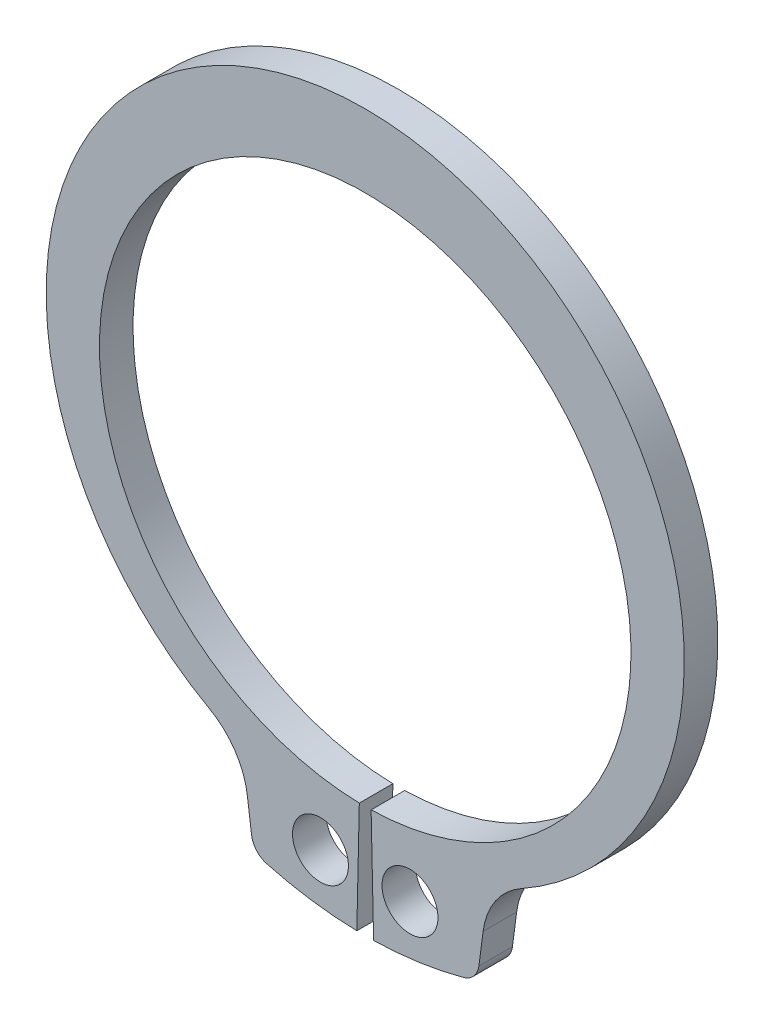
from build123d import *

# Parameters (mm, degrees)
BODYSKE_R  = 1
BODY_DEPTH = 1.2


with BuildPart() as part:
    # BodySke → Body (new body)
    with BuildSketch(Plane.XY):
        with BuildLine():
            Line((0.211111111, -9.497654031), (0.3, -13.496666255))
            ThreePointArc((0.3, -13.496666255), (1.921138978, -13.362605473), (3.51438519, -13.034534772))
            ThreePointArc((3.51438519, -13.034534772), (3.88340678, -12.804463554), (4.062725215, -12.408288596))
            Line((4.062725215, -12.408288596), (4.214292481, -11.257020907))
            ThreePointArc((4.214292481, -11.257020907), (4.655971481, -10.095118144), (5.571549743, -9.254395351))
            ThreePointArc((5.571549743, -9.254395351), (0, 12.1), (-5.571549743, -9.254395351))
            ThreePointArc((-5.571549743, -9.254395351), (-4.655971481, -10.095118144), (-4.214292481, -11.257020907))
            Line((-4.214292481, -11.257020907), (-4.062725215, -12.408288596))
            ThreePointArc((-4.062725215, -12.408288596), (-3.88340678, -12.804463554), (-3.51438519, -13.034534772))
            ThreePointArc((-3.51438519, -13.034534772), (-1.921138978, -13.362605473), (-0.3, -13.496666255))
            Line((-0.3, -13.496666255), (-0.211111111, -9.497654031))
            ThreePointArc((-0.211111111, -9.497654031), (0, 9.5), (0.211111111, -9.497654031))
        make_face()
        with Locations((1.6, -11.640554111)):
            Circle(BODYSKE_R, mode=Mode.SUBTRACT)
        with Locations((-1.6, -11.640554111)):
            Circle(BODYSKE_R, mode=Mode.SUBTRACT)
    extrude(amount=-BODY_DEPTH)


solid = part.part
